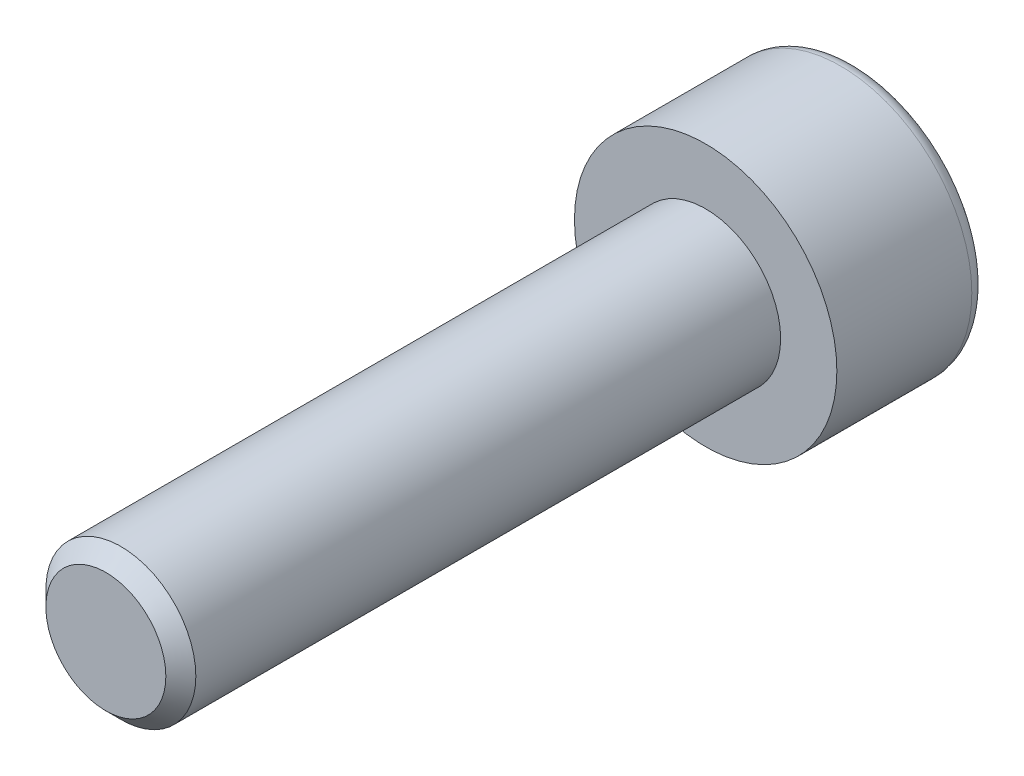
ISO-10303-21;
HEADER;
FILE_DESCRIPTION(('STEP AP214'),'2;1');
FILE_NAME('part.step','',(''),(''),'','','');
FILE_SCHEMA(('AUTOMOTIVE_DESIGN { 1 0 10303 214 1 1 1 1 }'));
ENDSEC;
DATA;
#1=APPLICATION_CONTEXT('core data for automotive mechanical design processes');
#2=APPLICATION_PROTOCOL_DEFINITION('international standard','automotive_design',2000,#1);
#3=PRODUCT_CONTEXT('',#1,'mechanical');
#4=PRODUCT('Part','Part','',(#3));
#5=PRODUCT_RELATED_PRODUCT_CATEGORY('part','',(#4));
#6=PRODUCT_DEFINITION_FORMATION('','',#4);
#7=PRODUCT_DEFINITION_CONTEXT('part definition',#1,'design');
#8=PRODUCT_DEFINITION('design','',#6,#7);
#9=PRODUCT_DEFINITION_SHAPE('','',#8);
#10=(LENGTH_UNIT() NAMED_UNIT(*) SI_UNIT(.MILLI.,.METRE.));
#11=(NAMED_UNIT(*) PLANE_ANGLE_UNIT() SI_UNIT($,.RADIAN.));
#12=(NAMED_UNIT(*) SI_UNIT($,.STERADIAN.) SOLID_ANGLE_UNIT());
#13=UNCERTAINTY_MEASURE_WITH_UNIT(LENGTH_MEASURE(1.E-05),#10,'distance_accuracy_value','');
#14=(GEOMETRIC_REPRESENTATION_CONTEXT(3) GLOBAL_UNCERTAINTY_ASSIGNED_CONTEXT((#13)) GLOBAL_UNIT_ASSIGNED_CONTEXT((#10,
#11,#12)) REPRESENTATION_CONTEXT('',''));
#15=CARTESIAN_POINT('',(0.,0.,0.));
#16=DIRECTION('',(0.,0.,1.));
#17=DIRECTION('',(1.,0.,0.));
#18=AXIS2_PLACEMENT_3D('',#15,#16,#17);
#19=CARTESIAN_POINT('',(0.,0.,-4.));
#20=DIRECTION('',(0.,0.,1.));
#21=DIRECTION('',(1.,0.,0.));
#22=AXIS2_PLACEMENT_3D('',#19,#20,#21);
#23=PLANE('',#22);
#24=CARTESIAN_POINT('',(0.,0.,-4.));
#25=DIRECTION('',(0.,0.,-1.));
#26=DIRECTION('',(-1.,0.,0.));
#27=AXIS2_PLACEMENT_3D('',#24,#25,#26);
#28=CIRCLE('',#27,3.1);
#29=CARTESIAN_POINT('',(-3.1,0.,-4.));
#30=VERTEX_POINT('',#29);
#31=EDGE_CURVE('E139',#30,#30,#28,.T.);
#32=ORIENTED_EDGE('',*,*,#31,.T.);
#33=EDGE_LOOP('',(#32));
#34=FACE_BOUND('',#33,.T.);
#35=DIRECTION('',(-0.866025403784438,-0.500000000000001,0.));
#36=VECTOR('',#35,1.);
#37=CARTESIAN_POINT('',(0.,1.73205080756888,-4.));
#38=LINE('',#37,#36);
#39=CARTESIAN_POINT('',(0.,1.73205080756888,-4.));
#40=VERTEX_POINT('',#39);
#41=CARTESIAN_POINT('',(-1.5,0.866025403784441,-4.));
#42=VERTEX_POINT('',#41);
#43=EDGE_CURVE('E83',#40,#42,#38,.T.);
#44=ORIENTED_EDGE('',*,*,#43,.T.);
#45=DIRECTION('',(0.,-1.,0.));
#46=VECTOR('',#45,1.);
#47=CARTESIAN_POINT('',(-1.5,-0.866025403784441,-4.));
#48=LINE('',#47,#46);
#49=CARTESIAN_POINT('',(-1.5,-0.866025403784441,-4.));
#50=VERTEX_POINT('',#49);
#51=EDGE_CURVE('E91',#42,#50,#48,.T.);
#52=ORIENTED_EDGE('',*,*,#51,.T.);
#53=DIRECTION('',(0.866025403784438,-0.500000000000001,0.));
#54=VECTOR('',#53,1.);
#55=CARTESIAN_POINT('',(0.,-1.73205080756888,-4.));
#56=LINE('',#55,#54);
#57=CARTESIAN_POINT('',(0.,-1.73205080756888,-4.));
#58=VERTEX_POINT('',#57);
#59=EDGE_CURVE('E109',#50,#58,#56,.T.);
#60=ORIENTED_EDGE('',*,*,#59,.T.);
#61=DIRECTION('',(0.86602540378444,0.499999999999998,0.));
#62=VECTOR('',#61,1.);
#63=CARTESIAN_POINT('',(0.,-1.73205080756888,-4.));
#64=LINE('',#63,#62);
#65=CARTESIAN_POINT('',(1.5,-0.866025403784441,-4.));
#66=VERTEX_POINT('',#65);
#67=EDGE_CURVE('E112',#58,#66,#64,.T.);
#68=ORIENTED_EDGE('',*,*,#67,.T.);
#69=DIRECTION('',(0.,1.,0.));
#70=VECTOR('',#69,1.);
#71=CARTESIAN_POINT('',(1.5,-0.866025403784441,-4.));
#72=LINE('',#71,#70);
#73=CARTESIAN_POINT('',(1.5,0.866025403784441,-4.));
#74=VERTEX_POINT('',#73);
#75=EDGE_CURVE('E102',#66,#74,#72,.T.);
#76=ORIENTED_EDGE('',*,*,#75,.T.);
#77=DIRECTION('',(-0.86602540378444,0.499999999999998,0.));
#78=VECTOR('',#77,1.);
#79=CARTESIAN_POINT('',(0.,1.73205080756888,-4.));
#80=LINE('',#79,#78);
#81=EDGE_CURVE('E43',#74,#40,#80,.T.);
#82=ORIENTED_EDGE('',*,*,#81,.T.);
#83=EDGE_LOOP('',(#44,#52,#60,#68,#76,#82));
#84=FACE_BOUND('',#83,.T.);
#85=ADVANCED_FACE('F29',(#34,#84),#23,.F.);
#86=CARTESIAN_POINT('',(0.,0.,-3.6));
#87=DIRECTION('',(0.,0.,-1.));
#88=DIRECTION('',(-1.,0.,0.));
#89=AXIS2_PLACEMENT_3D('',#86,#87,#88);
#90=TOROIDAL_SURFACE('',#89,3.1,0.4);
#91=ORIENTED_EDGE('',*,*,#31,.F.);
#92=EDGE_LOOP('',(#91));
#93=FACE_BOUND('',#92,.T.);
#94=CARTESIAN_POINT('',(0.,0.,-3.6));
#95=DIRECTION('',(0.,0.,-1.));
#96=DIRECTION('',(-1.,0.,0.));
#97=AXIS2_PLACEMENT_3D('',#94,#95,#96);
#98=CIRCLE('',#97,3.5);
#99=CARTESIAN_POINT('',(-3.5,0.,-3.6));
#100=VERTEX_POINT('',#99);
#101=EDGE_CURVE('E136',#100,#100,#98,.T.);
#102=ORIENTED_EDGE('',*,*,#101,.T.);
#103=EDGE_LOOP('',(#102));
#104=FACE_BOUND('',#103,.T.);
#105=ADVANCED_FACE('F158',(#93,#104),#90,.T.);
#106=CARTESIAN_POINT('',(0.,0.,0.));
#107=DIRECTION('',(0.,0.,-1.));
#108=DIRECTION('',(-1.,0.,0.));
#109=AXIS2_PLACEMENT_3D('',#106,#107,#108);
#110=CYLINDRICAL_SURFACE('',#109,3.5);
#111=ORIENTED_EDGE('',*,*,#101,.F.);
#112=EDGE_LOOP('',(#111));
#113=FACE_BOUND('',#112,.T.);
#114=CARTESIAN_POINT('',(0.,0.,0.));
#115=DIRECTION('',(0.,0.,-1.));
#116=DIRECTION('',(-1.,0.,0.));
#117=AXIS2_PLACEMENT_3D('',#114,#115,#116);
#118=CIRCLE('',#117,3.5);
#119=CARTESIAN_POINT('',(-3.5,0.,0.));
#120=VERTEX_POINT('',#119);
#121=EDGE_CURVE('E97',#120,#120,#118,.T.);
#122=ORIENTED_EDGE('',*,*,#121,.T.);
#123=EDGE_LOOP('',(#122));
#124=FACE_BOUND('',#123,.T.);
#125=ADVANCED_FACE('F163',(#113,#124),#110,.T.);
#126=CARTESIAN_POINT('',(0.,0.,0.));
#127=DIRECTION('',(0.,0.,-1.));
#128=DIRECTION('',(-1.,0.,0.));
#129=AXIS2_PLACEMENT_3D('',#126,#127,#128);
#130=PLANE('',#129);
#131=CARTESIAN_POINT('',(0.,0.,0.));
#132=DIRECTION('',(0.,0.,1.));
#133=DIRECTION('',(1.,0.,0.));
#134=AXIS2_PLACEMENT_3D('',#131,#132,#133);
#135=CIRCLE('',#134,2.);
#136=CARTESIAN_POINT('',(2.,0.,0.));
#137=VERTEX_POINT('',#136);
#138=EDGE_CURVE('E103',#137,#137,#135,.T.);
#139=ORIENTED_EDGE('',*,*,#138,.F.);
#140=EDGE_LOOP('',(#139));
#141=FACE_BOUND('',#140,.T.);
#142=ORIENTED_EDGE('',*,*,#121,.F.);
#143=EDGE_LOOP('',(#142));
#144=FACE_BOUND('',#143,.T.);
#145=ADVANCED_FACE('F171',(#141,#144),#130,.F.);
#146=CARTESIAN_POINT('',(0.,1.73205080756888,-2.));
#147=DIRECTION('',(-0.499999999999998,-0.86602540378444,0.));
#148=DIRECTION('',(0.86602540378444,-0.499999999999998,0.));
#149=AXIS2_PLACEMENT_3D('',#146,#147,#148);
#150=PLANE('',#149);
#151=ORIENTED_EDGE('',*,*,#81,.F.);
#152=DIRECTION('',(0.,0.,-1.));
#153=VECTOR('',#152,1.);
#154=CARTESIAN_POINT('',(1.5,0.866025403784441,-2.));
#155=LINE('',#154,#153);
#156=CARTESIAN_POINT('',(1.5,0.866025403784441,-2.));
#157=VERTEX_POINT('',#156);
#158=EDGE_CURVE('E125',#157,#74,#155,.T.);
#159=ORIENTED_EDGE('',*,*,#158,.F.);
#160=DIRECTION('',(-0.86602540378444,0.499999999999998,0.));
#161=VECTOR('',#160,1.);
#162=CARTESIAN_POINT('',(0.,1.73205080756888,-2.));
#163=LINE('',#162,#161);
#164=CARTESIAN_POINT('',(0.,1.73205080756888,-2.));
#165=VERTEX_POINT('',#164);
#166=EDGE_CURVE('E96',#157,#165,#163,.T.);
#167=ORIENTED_EDGE('',*,*,#166,.T.);
#168=DIRECTION('',(0.,0.,-1.));
#169=VECTOR('',#168,1.);
#170=CARTESIAN_POINT('',(0.,1.73205080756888,-2.));
#171=LINE('',#170,#169);
#172=EDGE_CURVE('E85',#165,#40,#171,.T.);
#173=ORIENTED_EDGE('',*,*,#172,.T.);
#174=EDGE_LOOP('',(#151,#159,#167,#173));
#175=FACE_BOUND('',#174,.T.);
#176=ADVANCED_FACE('F94',(#175),#150,.T.);
#177=CARTESIAN_POINT('',(0.,1.73205080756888,-2.));
#178=DIRECTION('',(0.500000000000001,-0.866025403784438,0.));
#179=DIRECTION('',(0.866025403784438,0.500000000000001,0.));
#180=AXIS2_PLACEMENT_3D('',#177,#178,#179);
#181=PLANE('',#180);
#182=ORIENTED_EDGE('',*,*,#43,.F.);
#183=ORIENTED_EDGE('',*,*,#172,.F.);
#184=DIRECTION('',(-0.866025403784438,-0.500000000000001,0.));
#185=VECTOR('',#184,1.);
#186=CARTESIAN_POINT('',(0.,1.73205080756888,-2.));
#187=LINE('',#186,#185);
#188=CARTESIAN_POINT('',(-1.5,0.866025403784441,-2.));
#189=VERTEX_POINT('',#188);
#190=EDGE_CURVE('E116',#165,#189,#187,.T.);
#191=ORIENTED_EDGE('',*,*,#190,.T.);
#192=DIRECTION('',(0.,0.,-1.));
#193=VECTOR('',#192,1.);
#194=CARTESIAN_POINT('',(-1.5,0.866025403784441,-2.));
#195=LINE('',#194,#193);
#196=EDGE_CURVE('E87',#189,#42,#195,.T.);
#197=ORIENTED_EDGE('',*,*,#196,.T.);
#198=EDGE_LOOP('',(#182,#183,#191,#197));
#199=FACE_BOUND('',#198,.T.);
#200=ADVANCED_FACE('F84',(#199),#181,.T.);
#201=CARTESIAN_POINT('',(-1.5,-0.866025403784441,-2.));
#202=DIRECTION('',(1.,0.,0.));
#203=DIRECTION('',(0.,0.,-1.));
#204=AXIS2_PLACEMENT_3D('',#201,#202,#203);
#205=PLANE('',#204);
#206=ORIENTED_EDGE('',*,*,#51,.F.);
#207=ORIENTED_EDGE('',*,*,#196,.F.);
#208=DIRECTION('',(0.,-1.,0.));
#209=VECTOR('',#208,1.);
#210=CARTESIAN_POINT('',(-1.5,-0.866025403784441,-2.));
#211=LINE('',#210,#209);
#212=CARTESIAN_POINT('',(-1.5,-0.866025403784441,-2.));
#213=VERTEX_POINT('',#212);
#214=EDGE_CURVE('E118',#189,#213,#211,.T.);
#215=ORIENTED_EDGE('',*,*,#214,.T.);
#216=DIRECTION('',(0.,0.,-1.));
#217=VECTOR('',#216,1.);
#218=CARTESIAN_POINT('',(-1.5,-0.866025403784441,-2.));
#219=LINE('',#218,#217);
#220=EDGE_CURVE('E131',#213,#50,#219,.T.);
#221=ORIENTED_EDGE('',*,*,#220,.T.);
#222=EDGE_LOOP('',(#206,#207,#215,#221));
#223=FACE_BOUND('',#222,.T.);
#224=ADVANCED_FACE('F186',(#223),#205,.T.);
#225=CARTESIAN_POINT('',(0.,-1.73205080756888,-2.));
#226=DIRECTION('',(0.500000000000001,0.866025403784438,0.));
#227=DIRECTION('',(-0.866025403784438,0.500000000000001,0.));
#228=AXIS2_PLACEMENT_3D('',#225,#226,#227);
#229=PLANE('',#228);
#230=ORIENTED_EDGE('',*,*,#59,.F.);
#231=ORIENTED_EDGE('',*,*,#220,.F.);
#232=DIRECTION('',(0.866025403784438,-0.500000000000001,0.));
#233=VECTOR('',#232,1.);
#234=CARTESIAN_POINT('',(0.,-1.73205080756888,-2.));
#235=LINE('',#234,#233);
#236=CARTESIAN_POINT('',(0.,-1.73205080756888,-2.));
#237=VERTEX_POINT('',#236);
#238=EDGE_CURVE('E120',#213,#237,#235,.T.);
#239=ORIENTED_EDGE('',*,*,#238,.T.);
#240=DIRECTION('',(0.,0.,-1.));
#241=VECTOR('',#240,1.);
#242=CARTESIAN_POINT('',(0.,-1.73205080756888,-2.));
#243=LINE('',#242,#241);
#244=EDGE_CURVE('E129',#237,#58,#243,.T.);
#245=ORIENTED_EDGE('',*,*,#244,.T.);
#246=EDGE_LOOP('',(#230,#231,#239,#245));
#247=FACE_BOUND('',#246,.T.);
#248=ADVANCED_FACE('F189',(#247),#229,.T.);
#249=CARTESIAN_POINT('',(0.,-1.73205080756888,-2.));
#250=DIRECTION('',(-0.499999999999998,0.86602540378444,0.));
#251=DIRECTION('',(-0.86602540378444,-0.499999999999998,0.));
#252=AXIS2_PLACEMENT_3D('',#249,#250,#251);
#253=PLANE('',#252);
#254=ORIENTED_EDGE('',*,*,#67,.F.);
#255=ORIENTED_EDGE('',*,*,#244,.F.);
#256=DIRECTION('',(0.86602540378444,0.499999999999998,0.));
#257=VECTOR('',#256,1.);
#258=CARTESIAN_POINT('',(0.,-1.73205080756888,-2.));
#259=LINE('',#258,#257);
#260=CARTESIAN_POINT('',(1.5,-0.866025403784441,-2.));
#261=VERTEX_POINT('',#260);
#262=EDGE_CURVE('E122',#237,#261,#259,.T.);
#263=ORIENTED_EDGE('',*,*,#262,.T.);
#264=DIRECTION('',(0.,0.,-1.));
#265=VECTOR('',#264,1.);
#266=CARTESIAN_POINT('',(1.5,-0.866025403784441,-2.));
#267=LINE('',#266,#265);
#268=EDGE_CURVE('E127',#261,#66,#267,.T.);
#269=ORIENTED_EDGE('',*,*,#268,.T.);
#270=EDGE_LOOP('',(#254,#255,#263,#269));
#271=FACE_BOUND('',#270,.T.);
#272=ADVANCED_FACE('F193',(#271),#253,.T.);
#273=CARTESIAN_POINT('',(1.5,-0.866025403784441,-2.));
#274=DIRECTION('',(-1.,0.,0.));
#275=DIRECTION('',(0.,0.,1.));
#276=AXIS2_PLACEMENT_3D('',#273,#274,#275);
#277=PLANE('',#276);
#278=ORIENTED_EDGE('',*,*,#75,.F.);
#279=ORIENTED_EDGE('',*,*,#268,.F.);
#280=DIRECTION('',(0.,1.,0.));
#281=VECTOR('',#280,1.);
#282=CARTESIAN_POINT('',(1.5,-0.866025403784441,-2.));
#283=LINE('',#282,#281);
#284=EDGE_CURVE('E50',#261,#157,#283,.T.);
#285=ORIENTED_EDGE('',*,*,#284,.T.);
#286=ORIENTED_EDGE('',*,*,#158,.T.);
#287=EDGE_LOOP('',(#278,#279,#285,#286));
#288=FACE_BOUND('',#287,.T.);
#289=ADVANCED_FACE('F197',(#288),#277,.T.);
#290=CARTESIAN_POINT('',(1.5,0.866025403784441,-2.));
#291=DIRECTION('',(0.,0.,1.));
#292=DIRECTION('',(1.,0.,0.));
#293=AXIS2_PLACEMENT_3D('',#290,#291,#292);
#294=PLANE('',#293);
#295=ORIENTED_EDGE('',*,*,#166,.F.);
#296=ORIENTED_EDGE('',*,*,#284,.F.);
#297=ORIENTED_EDGE('',*,*,#262,.F.);
#298=ORIENTED_EDGE('',*,*,#238,.F.);
#299=ORIENTED_EDGE('',*,*,#214,.F.);
#300=ORIENTED_EDGE('',*,*,#190,.F.);
#301=EDGE_LOOP('',(#295,#296,#297,#298,#299,#300));
#302=FACE_BOUND('',#301,.T.);
#303=ADVANCED_FACE('F201',(#302),#294,.F.);
#304=CARTESIAN_POINT('',(0.,0.,16.));
#305=DIRECTION('',(0.,0.,1.));
#306=DIRECTION('',(1.,0.,0.));
#307=AXIS2_PLACEMENT_3D('',#304,#305,#306);
#308=PLANE('',#307);
#309=CARTESIAN_POINT('',(0.,0.,16.));
#310=DIRECTION('',(0.,0.,1.));
#311=DIRECTION('',(1.,0.,0.));
#312=AXIS2_PLACEMENT_3D('',#309,#310,#311);
#313=CIRCLE('',#312,1.6);
#314=CARTESIAN_POINT('',(1.6,0.,16.));
#315=VERTEX_POINT('',#314);
#316=EDGE_CURVE('E36',#315,#315,#313,.T.);
#317=ORIENTED_EDGE('',*,*,#316,.T.);
#318=EDGE_LOOP('',(#317));
#319=FACE_BOUND('',#318,.T.);
#320=ADVANCED_FACE('F144',(#319),#308,.T.);
#321=CARTESIAN_POINT('',(0.,0.,0.));
#322=DIRECTION('',(0.,0.,1.));
#323=DIRECTION('',(1.,0.,0.));
#324=AXIS2_PLACEMENT_3D('',#321,#322,#323);
#325=CYLINDRICAL_SURFACE('',#324,2.);
#326=CARTESIAN_POINT('',(0.,0.,15.6));
#327=DIRECTION('',(0.,0.,1.));
#328=DIRECTION('',(1.,0.,0.));
#329=AXIS2_PLACEMENT_3D('',#326,#327,#328);
#330=CIRCLE('',#329,2.);
#331=CARTESIAN_POINT('',(2.,0.,15.6));
#332=VERTEX_POINT('',#331);
#333=EDGE_CURVE('E11',#332,#332,#330,.F.);
#334=ORIENTED_EDGE('',*,*,#333,.T.);
#335=EDGE_LOOP('',(#334));
#336=FACE_BOUND('',#335,.T.);
#337=ORIENTED_EDGE('',*,*,#138,.T.);
#338=EDGE_LOOP('',(#337));
#339=FACE_BOUND('',#338,.T.);
#340=ADVANCED_FACE('F148',(#336,#339),#325,.T.);
#341=CARTESIAN_POINT('',(0.,0.,16.));
#342=DIRECTION('',(0.,0.,-1.));
#343=DIRECTION('',(-1.,0.,0.));
#344=AXIS2_PLACEMENT_3D('',#341,#342,#343);
#345=CONICAL_SURFACE('',#344,1.6,0.785398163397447);
#346=ORIENTED_EDGE('',*,*,#333,.F.);
#347=EDGE_LOOP('',(#346));
#348=FACE_BOUND('',#347,.T.);
#349=ORIENTED_EDGE('',*,*,#316,.F.);
#350=EDGE_LOOP('',(#349));
#351=FACE_BOUND('',#350,.T.);
#352=ADVANCED_FACE('F146',(#348,#351),#345,.T.);
#353=CLOSED_SHELL('',(#85,#105,#125,#145,#176,#200,#224,#248,#272,#289,#303,#320,#340,#352));
#354=MANIFOLD_SOLID_BREP('B2',#353);
#355=ADVANCED_BREP_SHAPE_REPRESENTATION('',(#18,#354),#14);
#356=SHAPE_DEFINITION_REPRESENTATION(#9,#355);
ENDSEC;
END-ISO-10303-21;
